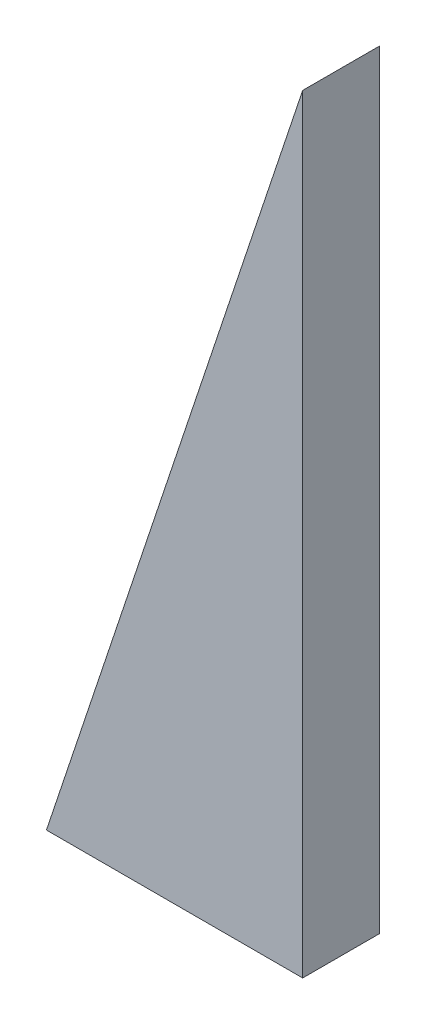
ISO-10303-21;
HEADER;
FILE_DESCRIPTION(('STEP AP214'),'2;1');
FILE_NAME('part.step','',(''),(''),'','','');
FILE_SCHEMA(('AUTOMOTIVE_DESIGN { 1 0 10303 214 1 1 1 1 }'));
ENDSEC;
DATA;
#1=APPLICATION_CONTEXT('core data for automotive mechanical design processes');
#2=APPLICATION_PROTOCOL_DEFINITION('international standard','automotive_design',2000,#1);
#3=PRODUCT_CONTEXT('',#1,'mechanical');
#4=PRODUCT('Part','Part','',(#3));
#5=PRODUCT_RELATED_PRODUCT_CATEGORY('part','',(#4));
#6=PRODUCT_DEFINITION_FORMATION('','',#4);
#7=PRODUCT_DEFINITION_CONTEXT('part definition',#1,'design');
#8=PRODUCT_DEFINITION('design','',#6,#7);
#9=PRODUCT_DEFINITION_SHAPE('','',#8);
#10=(LENGTH_UNIT() NAMED_UNIT(*) SI_UNIT(.MILLI.,.METRE.));
#11=(NAMED_UNIT(*) PLANE_ANGLE_UNIT() SI_UNIT($,.RADIAN.));
#12=(NAMED_UNIT(*) SI_UNIT($,.STERADIAN.) SOLID_ANGLE_UNIT());
#13=UNCERTAINTY_MEASURE_WITH_UNIT(LENGTH_MEASURE(1.E-05),#10,'distance_accuracy_value','');
#14=(GEOMETRIC_REPRESENTATION_CONTEXT(3) GLOBAL_UNCERTAINTY_ASSIGNED_CONTEXT((#13)) GLOBAL_UNIT_ASSIGNED_CONTEXT((#10,
#11,#12)) REPRESENTATION_CONTEXT('',''));
#15=CARTESIAN_POINT('',(0.,0.,0.));
#16=DIRECTION('',(0.,0.,1.));
#17=DIRECTION('',(1.,0.,0.));
#18=AXIS2_PLACEMENT_3D('',#15,#16,#17);
#19=CARTESIAN_POINT('',(10.,30.,3.));
#20=DIRECTION('',(0.948683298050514,-0.316227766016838,0.));
#21=DIRECTION('',(0.316227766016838,0.948683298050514,0.));
#22=AXIS2_PLACEMENT_3D('',#19,#20,#21);
#23=PLANE('',#22);
#24=DIRECTION('',(-0.316227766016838,-0.948683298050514,0.));
#25=VECTOR('',#24,1.);
#26=CARTESIAN_POINT('',(10.,30.,0.));
#27=LINE('',#26,#25);
#28=CARTESIAN_POINT('',(10.,30.,0.));
#29=VERTEX_POINT('',#28);
#30=CARTESIAN_POINT('',(0.,0.,0.));
#31=VERTEX_POINT('',#30);
#32=EDGE_CURVE('E80',#29,#31,#27,.T.);
#33=ORIENTED_EDGE('',*,*,#32,.T.);
#34=DIRECTION('',(0.,0.,-1.));
#35=VECTOR('',#34,1.);
#36=CARTESIAN_POINT('',(0.,0.,3.));
#37=LINE('',#36,#35);
#38=CARTESIAN_POINT('',(0.,0.,3.));
#39=VERTEX_POINT('',#38);
#40=EDGE_CURVE('E11',#39,#31,#37,.T.);
#41=ORIENTED_EDGE('',*,*,#40,.F.);
#42=DIRECTION('',(-0.316227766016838,-0.948683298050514,0.));
#43=VECTOR('',#42,1.);
#44=CARTESIAN_POINT('',(10.,30.,3.));
#45=LINE('',#44,#43);
#46=CARTESIAN_POINT('',(10.,30.,3.));
#47=VERTEX_POINT('',#46);
#48=EDGE_CURVE('E73',#47,#39,#45,.T.);
#49=ORIENTED_EDGE('',*,*,#48,.F.);
#50=DIRECTION('',(0.,0.,-1.));
#51=VECTOR('',#50,1.);
#52=CARTESIAN_POINT('',(10.,30.,3.));
#53=LINE('',#52,#51);
#54=EDGE_CURVE('E81',#47,#29,#53,.T.);
#55=ORIENTED_EDGE('',*,*,#54,.T.);
#56=EDGE_LOOP('',(#33,#41,#49,#55));
#57=FACE_BOUND('',#56,.T.);
#58=ADVANCED_FACE('F33',(#57),#23,.F.);
#59=CARTESIAN_POINT('',(0.,0.,3.));
#60=DIRECTION('',(0.,1.,0.));
#61=DIRECTION('',(0.,0.,1.));
#62=AXIS2_PLACEMENT_3D('',#59,#60,#61);
#63=PLANE('',#62);
#64=DIRECTION('',(1.,0.,0.));
#65=VECTOR('',#64,1.);
#66=CARTESIAN_POINT('',(0.,0.,0.));
#67=LINE('',#66,#65);
#68=CARTESIAN_POINT('',(10.,0.,0.));
#69=VERTEX_POINT('',#68);
#70=EDGE_CURVE('E61',#31,#69,#67,.T.);
#71=ORIENTED_EDGE('',*,*,#70,.T.);
#72=DIRECTION('',(0.,0.,-1.));
#73=VECTOR('',#72,1.);
#74=CARTESIAN_POINT('',(10.,0.,3.));
#75=LINE('',#74,#73);
#76=CARTESIAN_POINT('',(10.,0.,3.));
#77=VERTEX_POINT('',#76);
#78=EDGE_CURVE('E41',#77,#69,#75,.T.);
#79=ORIENTED_EDGE('',*,*,#78,.F.);
#80=DIRECTION('',(1.,0.,0.));
#81=VECTOR('',#80,1.);
#82=CARTESIAN_POINT('',(0.,0.,3.));
#83=LINE('',#82,#81);
#84=EDGE_CURVE('E69',#39,#77,#83,.T.);
#85=ORIENTED_EDGE('',*,*,#84,.F.);
#86=ORIENTED_EDGE('',*,*,#40,.T.);
#87=EDGE_LOOP('',(#71,#79,#85,#86));
#88=FACE_BOUND('',#87,.T.);
#89=ADVANCED_FACE('F70',(#88),#63,.F.);
#90=CARTESIAN_POINT('',(10.,0.,3.));
#91=DIRECTION('',(-1.,0.,0.));
#92=DIRECTION('',(0.,0.,1.));
#93=AXIS2_PLACEMENT_3D('',#90,#91,#92);
#94=PLANE('',#93);
#95=DIRECTION('',(0.,1.,0.));
#96=VECTOR('',#95,1.);
#97=CARTESIAN_POINT('',(10.,0.,0.));
#98=LINE('',#97,#96);
#99=EDGE_CURVE('E66',#69,#29,#98,.T.);
#100=ORIENTED_EDGE('',*,*,#99,.T.);
#101=ORIENTED_EDGE('',*,*,#54,.F.);
#102=DIRECTION('',(0.,1.,0.));
#103=VECTOR('',#102,1.);
#104=CARTESIAN_POINT('',(10.,0.,3.));
#105=LINE('',#104,#103);
#106=EDGE_CURVE('E49',#77,#47,#105,.T.);
#107=ORIENTED_EDGE('',*,*,#106,.F.);
#108=ORIENTED_EDGE('',*,*,#78,.T.);
#109=EDGE_LOOP('',(#100,#101,#107,#108));
#110=FACE_BOUND('',#109,.T.);
#111=ADVANCED_FACE('F88',(#110),#94,.F.);
#112=CARTESIAN_POINT('',(0.,0.,3.));
#113=DIRECTION('',(0.,0.,1.));
#114=DIRECTION('',(1.,0.,0.));
#115=AXIS2_PLACEMENT_3D('',#112,#113,#114);
#116=PLANE('',#115);
#117=ORIENTED_EDGE('',*,*,#48,.T.);
#118=ORIENTED_EDGE('',*,*,#84,.T.);
#119=ORIENTED_EDGE('',*,*,#106,.T.);
#120=EDGE_LOOP('',(#117,#118,#119));
#121=FACE_BOUND('',#120,.T.);
#122=ADVANCED_FACE('F76',(#121),#116,.T.);
#123=CARTESIAN_POINT('',(0.,0.,0.));
#124=DIRECTION('',(0.,0.,1.));
#125=DIRECTION('',(1.,0.,0.));
#126=AXIS2_PLACEMENT_3D('',#123,#124,#125);
#127=PLANE('',#126);
#128=ORIENTED_EDGE('',*,*,#32,.F.);
#129=ORIENTED_EDGE('',*,*,#99,.F.);
#130=ORIENTED_EDGE('',*,*,#70,.F.);
#131=EDGE_LOOP('',(#128,#129,#130));
#132=FACE_BOUND('',#131,.T.);
#133=ADVANCED_FACE('F89',(#132),#127,.F.);
#134=CLOSED_SHELL('',(#58,#89,#111,#122,#133));
#135=MANIFOLD_SOLID_BREP('B2',#134);
#136=ADVANCED_BREP_SHAPE_REPRESENTATION('',(#18,#135),#14);
#137=SHAPE_DEFINITION_REPRESENTATION(#9,#136);
ENDSEC;
END-ISO-10303-21;
